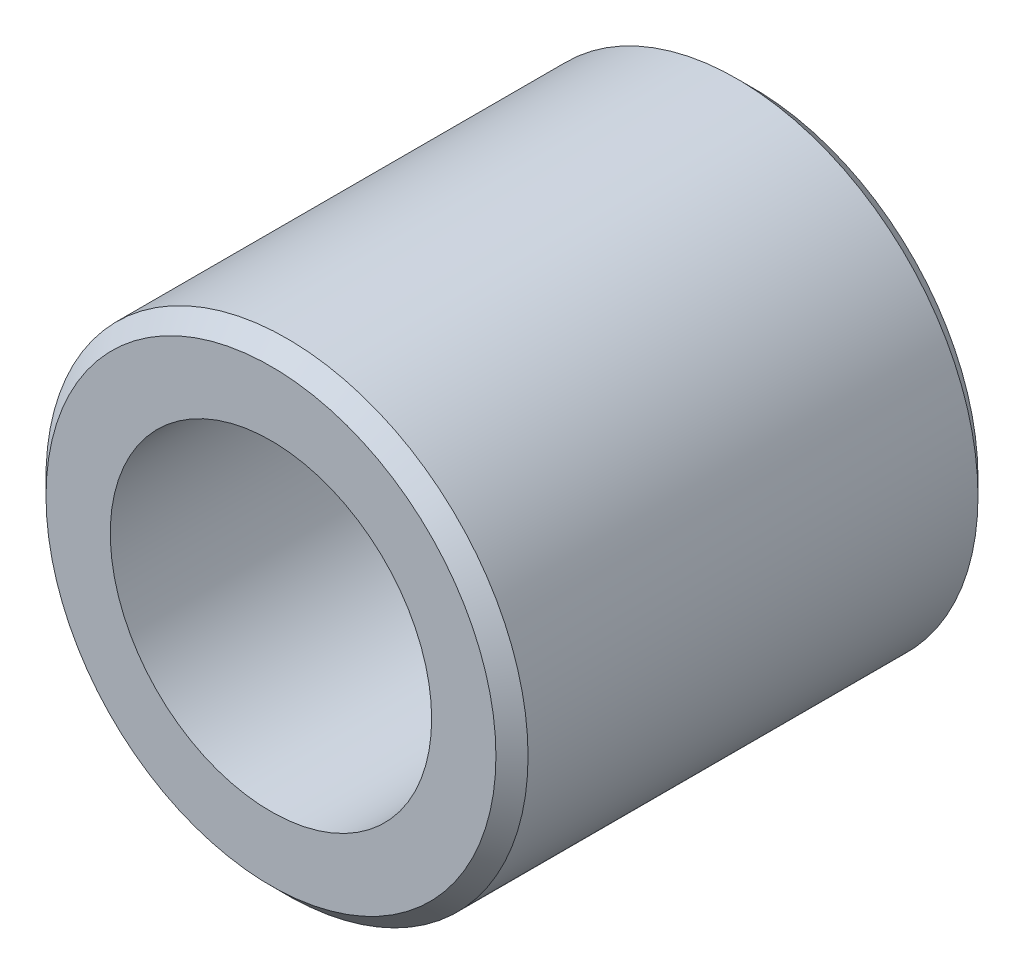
ISO-10303-21;
HEADER;
FILE_DESCRIPTION(('STEP AP214'),'2;1');
FILE_NAME('part.step','',(''),(''),'','','');
FILE_SCHEMA(('AUTOMOTIVE_DESIGN { 1 0 10303 214 1 1 1 1 }'));
ENDSEC;
DATA;
#1=APPLICATION_CONTEXT('core data for automotive mechanical design processes');
#2=APPLICATION_PROTOCOL_DEFINITION('international standard','automotive_design',2000,#1);
#3=PRODUCT_CONTEXT('',#1,'mechanical');
#4=PRODUCT('Part','Part','',(#3));
#5=PRODUCT_RELATED_PRODUCT_CATEGORY('part','',(#4));
#6=PRODUCT_DEFINITION_FORMATION('','',#4);
#7=PRODUCT_DEFINITION_CONTEXT('part definition',#1,'design');
#8=PRODUCT_DEFINITION('design','',#6,#7);
#9=PRODUCT_DEFINITION_SHAPE('','',#8);
#10=(LENGTH_UNIT() NAMED_UNIT(*) SI_UNIT(.MILLI.,.METRE.));
#11=(NAMED_UNIT(*) PLANE_ANGLE_UNIT() SI_UNIT($,.RADIAN.));
#12=(NAMED_UNIT(*) SI_UNIT($,.STERADIAN.) SOLID_ANGLE_UNIT());
#13=UNCERTAINTY_MEASURE_WITH_UNIT(LENGTH_MEASURE(1.E-05),#10,'distance_accuracy_value','');
#14=(GEOMETRIC_REPRESENTATION_CONTEXT(3) GLOBAL_UNCERTAINTY_ASSIGNED_CONTEXT((#13)) GLOBAL_UNIT_ASSIGNED_CONTEXT((#10,
#11,#12)) REPRESENTATION_CONTEXT('',''));
#15=CARTESIAN_POINT('',(0.,0.,0.));
#16=DIRECTION('',(0.,0.,1.));
#17=DIRECTION('',(1.,0.,0.));
#18=AXIS2_PLACEMENT_3D('',#15,#16,#17);
#19=CARTESIAN_POINT('',(0.,0.,26.25));
#20=DIRECTION('',(0.,0.,1.));
#21=DIRECTION('',(1.,0.,0.));
#22=AXIS2_PLACEMENT_3D('',#19,#20,#21);
#23=PLANE('',#22);
#24=CARTESIAN_POINT('',(0.,0.,26.25));
#25=DIRECTION('',(0.,0.,1.));
#26=DIRECTION('',(1.,0.,0.));
#27=AXIS2_PLACEMENT_3D('',#24,#25,#26);
#28=CIRCLE('',#27,10.5);
#29=CARTESIAN_POINT('',(10.5,0.,26.25));
#30=VERTEX_POINT('',#29);
#31=EDGE_CURVE('E10',#30,#30,#28,.T.);
#32=ORIENTED_EDGE('',*,*,#31,.T.);
#33=EDGE_LOOP('',(#32));
#34=FACE_BOUND('',#33,.T.);
#35=CARTESIAN_POINT('',(0.,0.,26.25));
#36=DIRECTION('',(0.,0.,1.));
#37=DIRECTION('',(1.,0.,0.));
#38=AXIS2_PLACEMENT_3D('',#35,#36,#37);
#39=CIRCLE('',#38,7.5);
#40=CARTESIAN_POINT('',(7.5,0.,26.25));
#41=VERTEX_POINT('',#40);
#42=EDGE_CURVE('E62',#41,#41,#39,.T.);
#43=ORIENTED_EDGE('',*,*,#42,.F.);
#44=EDGE_LOOP('',(#43));
#45=FACE_BOUND('',#44,.T.);
#46=ADVANCED_FACE('F38',(#34,#45),#23,.T.);
#47=CARTESIAN_POINT('',(0.,0.,3.75));
#48=DIRECTION('',(0.,0.,1.));
#49=DIRECTION('',(1.,0.,0.));
#50=AXIS2_PLACEMENT_3D('',#47,#48,#49);
#51=PLANE('',#50);
#52=CARTESIAN_POINT('',(0.,0.,3.75));
#53=DIRECTION('',(0.,0.,1.));
#54=DIRECTION('',(1.,0.,0.));
#55=AXIS2_PLACEMENT_3D('',#52,#53,#54);
#56=CIRCLE('',#55,10.5);
#57=CARTESIAN_POINT('',(10.5,0.,3.75));
#58=VERTEX_POINT('',#57);
#59=EDGE_CURVE('E46',#58,#58,#56,.F.);
#60=ORIENTED_EDGE('',*,*,#59,.T.);
#61=EDGE_LOOP('',(#60));
#62=FACE_BOUND('',#61,.T.);
#63=CARTESIAN_POINT('',(0.,0.,3.75));
#64=DIRECTION('',(0.,0.,1.));
#65=DIRECTION('',(1.,0.,0.));
#66=AXIS2_PLACEMENT_3D('',#63,#64,#65);
#67=CIRCLE('',#66,7.5);
#68=CARTESIAN_POINT('',(7.5,0.,3.75));
#69=VERTEX_POINT('',#68);
#70=EDGE_CURVE('E63',#69,#69,#67,.T.);
#71=ORIENTED_EDGE('',*,*,#70,.T.);
#72=EDGE_LOOP('',(#71));
#73=FACE_BOUND('',#72,.T.);
#74=ADVANCED_FACE('F75',(#62,#73),#51,.F.);
#75=CARTESIAN_POINT('',(0.,0.,26.25));
#76=DIRECTION('',(0.,0.,-1.));
#77=DIRECTION('',(-1.,0.,0.));
#78=AXIS2_PLACEMENT_3D('',#75,#76,#77);
#79=CYLINDRICAL_SURFACE('',#78,11.25);
#80=CARTESIAN_POINT('',(0.,0.,4.50000000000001));
#81=DIRECTION('',(0.,0.,1.));
#82=DIRECTION('',(1.,0.,0.));
#83=AXIS2_PLACEMENT_3D('',#80,#81,#82);
#84=CIRCLE('',#83,11.25);
#85=CARTESIAN_POINT('',(11.25,0.,4.50000000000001));
#86=VERTEX_POINT('',#85);
#87=EDGE_CURVE('E51',#86,#86,#84,.T.);
#88=ORIENTED_EDGE('',*,*,#87,.T.);
#89=EDGE_LOOP('',(#88));
#90=FACE_BOUND('',#89,.T.);
#91=CARTESIAN_POINT('',(0.,0.,25.5));
#92=DIRECTION('',(0.,0.,1.));
#93=DIRECTION('',(1.,0.,0.));
#94=AXIS2_PLACEMENT_3D('',#91,#92,#93);
#95=CIRCLE('',#94,11.25);
#96=CARTESIAN_POINT('',(11.25,0.,25.5));
#97=VERTEX_POINT('',#96);
#98=EDGE_CURVE('E56',#97,#97,#95,.F.);
#99=ORIENTED_EDGE('',*,*,#98,.T.);
#100=EDGE_LOOP('',(#99));
#101=FACE_BOUND('',#100,.T.);
#102=ADVANCED_FACE('F80',(#90,#101),#79,.T.);
#103=CARTESIAN_POINT('',(0.,0.,26.25));
#104=DIRECTION('',(0.,0.,-1.));
#105=DIRECTION('',(-1.,0.,0.));
#106=AXIS2_PLACEMENT_3D('',#103,#104,#105);
#107=CYLINDRICAL_SURFACE('',#106,7.5);
#108=ORIENTED_EDGE('',*,*,#42,.T.);
#109=EDGE_LOOP('',(#108));
#110=FACE_BOUND('',#109,.T.);
#111=ORIENTED_EDGE('',*,*,#70,.F.);
#112=EDGE_LOOP('',(#111));
#113=FACE_BOUND('',#112,.T.);
#114=ADVANCED_FACE('F71',(#110,#113),#107,.F.);
#115=CARTESIAN_POINT('',(0.,0.,4.50000000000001));
#116=DIRECTION('',(0.,0.,1.));
#117=DIRECTION('',(1.,0.,0.));
#118=AXIS2_PLACEMENT_3D('',#115,#116,#117);
#119=CONICAL_SURFACE('',#118,11.25,0.785398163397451);
#120=ORIENTED_EDGE('',*,*,#59,.F.);
#121=EDGE_LOOP('',(#120));
#122=FACE_BOUND('',#121,.T.);
#123=ORIENTED_EDGE('',*,*,#87,.F.);
#124=EDGE_LOOP('',(#123));
#125=FACE_BOUND('',#124,.T.);
#126=ADVANCED_FACE('F86',(#122,#125),#119,.T.);
#127=CARTESIAN_POINT('',(0.,0.,26.25));
#128=DIRECTION('',(0.,0.,-1.));
#129=DIRECTION('',(-1.,0.,0.));
#130=AXIS2_PLACEMENT_3D('',#127,#128,#129);
#131=CONICAL_SURFACE('',#130,10.5,0.785398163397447);
#132=ORIENTED_EDGE('',*,*,#98,.F.);
#133=EDGE_LOOP('',(#132));
#134=FACE_BOUND('',#133,.T.);
#135=ORIENTED_EDGE('',*,*,#31,.F.);
#136=EDGE_LOOP('',(#135));
#137=FACE_BOUND('',#136,.T.);
#138=ADVANCED_FACE('F40',(#134,#137),#131,.T.);
#139=CLOSED_SHELL('',(#46,#74,#102,#114,#126,#138));
#140=MANIFOLD_SOLID_BREP('B2',#139);
#141=ADVANCED_BREP_SHAPE_REPRESENTATION('',(#18,#140),#14);
#142=SHAPE_DEFINITION_REPRESENTATION(#9,#141);
ENDSEC;
END-ISO-10303-21;
